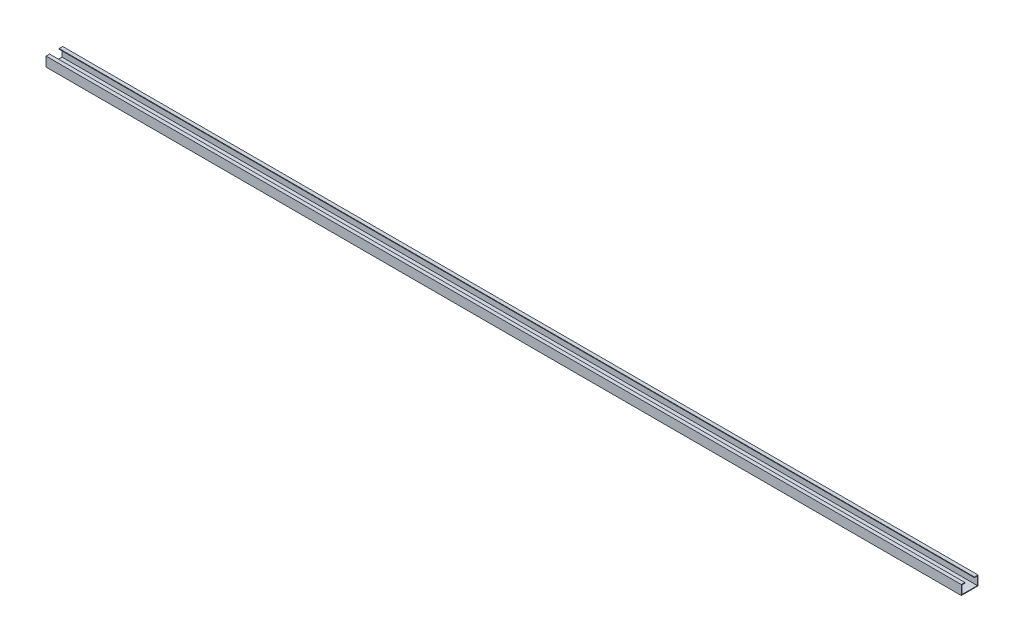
from build123d import *

# Parameters (mm, degrees)
EXTRUDE_THIN1_DEPTH = 2438.4


with BuildPart() as part:
    # Sketch1 → Extrude-Thin1 (new body)
    with BuildSketch(Plane(origin=(0, 0, 0), x_dir=(0, 0, -1), z_dir=(1, 0, 0))):
        Polygon((-12.7, 25.4), (-22.225, 25.4), (-22.225, 0), (22.225, 0), (22.225, 25.4), (12.7, 25.4), (12.7, 23.7998), (20.6248, 23.7998), (20.6248, 1.6002), (-20.6248, 1.6002), (-20.6248, 23.7998), (-12.7, 23.7998), align=None)
    extrude(amount=EXTRUDE_THIN1_DEPTH)


solid = part.part
